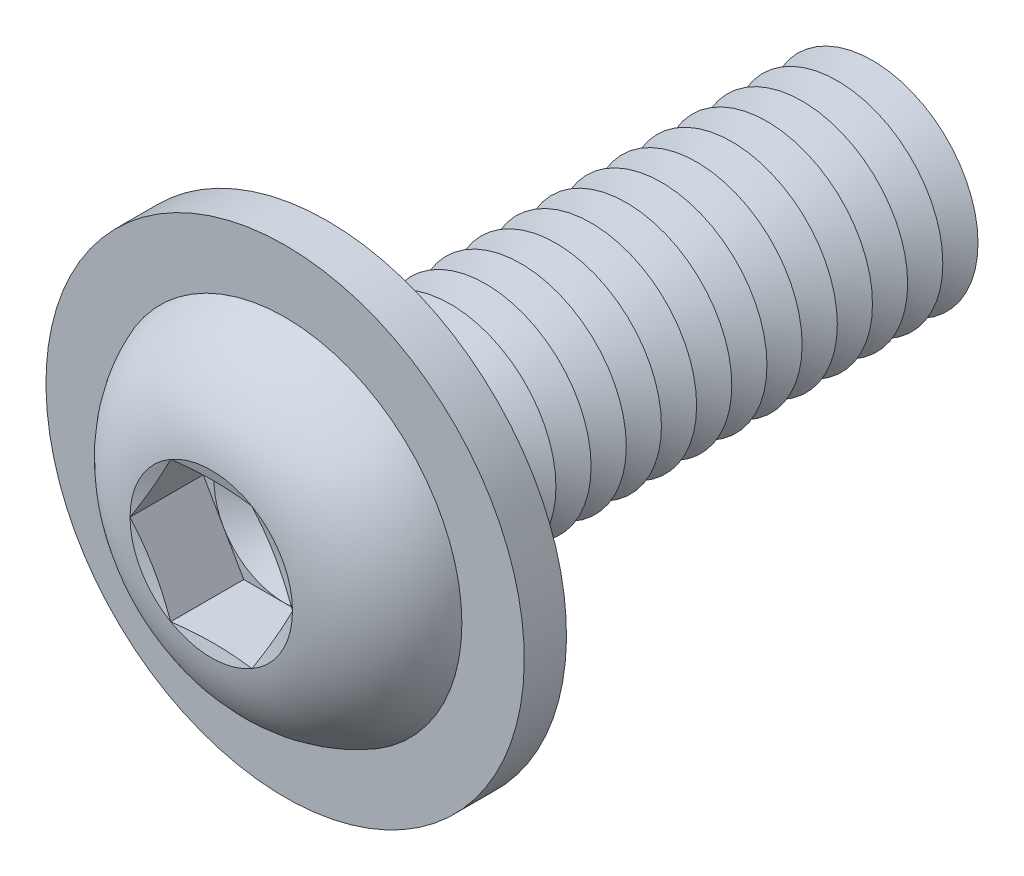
ISO-10303-21;
HEADER;
FILE_DESCRIPTION(('STEP AP214'),'2;1');
FILE_NAME('part.step','',(''),(''),'','','');
FILE_SCHEMA(('AUTOMOTIVE_DESIGN { 1 0 10303 214 1 1 1 1 }'));
ENDSEC;
DATA;
#1=APPLICATION_CONTEXT('core data for automotive mechanical design processes');
#2=APPLICATION_PROTOCOL_DEFINITION('international standard','automotive_design',2000,#1);
#3=PRODUCT_CONTEXT('',#1,'mechanical');
#4=PRODUCT('Part','Part','',(#3));
#5=PRODUCT_RELATED_PRODUCT_CATEGORY('part','',(#4));
#6=PRODUCT_DEFINITION_FORMATION('','',#4);
#7=PRODUCT_DEFINITION_CONTEXT('part definition',#1,'design');
#8=PRODUCT_DEFINITION('design','',#6,#7);
#9=PRODUCT_DEFINITION_SHAPE('','',#8);
#10=(LENGTH_UNIT() NAMED_UNIT(*) SI_UNIT(.MILLI.,.METRE.));
#11=(NAMED_UNIT(*) PLANE_ANGLE_UNIT() SI_UNIT($,.RADIAN.));
#12=(NAMED_UNIT(*) SI_UNIT($,.STERADIAN.) SOLID_ANGLE_UNIT());
#13=UNCERTAINTY_MEASURE_WITH_UNIT(LENGTH_MEASURE(1.E-05),#10,'distance_accuracy_value','');
#14=(GEOMETRIC_REPRESENTATION_CONTEXT(3) GLOBAL_UNCERTAINTY_ASSIGNED_CONTEXT((#13)) GLOBAL_UNIT_ASSIGNED_CONTEXT((#10,
#11,#12)) REPRESENTATION_CONTEXT('',''));
#15=CARTESIAN_POINT('',(0.,0.,0.));
#16=DIRECTION('',(0.,0.,1.));
#17=DIRECTION('',(1.,0.,0.));
#18=AXIS2_PLACEMENT_3D('',#15,#16,#17);
#19=CARTESIAN_POINT('',(0.,0.,-12.5));
#20=DIRECTION('',(0.,0.,1.));
#21=DIRECTION('',(1.,0.,0.));
#22=AXIS2_PLACEMENT_3D('',#19,#20,#21);
#23=CONICAL_SURFACE('',#22,3.00000000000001,1.0471975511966);
#24=CARTESIAN_POINT('',(0.,0.,-13.));
#25=DIRECTION('',(0.,0.,1.));
#26=DIRECTION('',(1.,0.,0.));
#27=AXIS2_PLACEMENT_3D('',#24,#25,#26);
#28=CIRCLE('',#27,2.13397459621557);
#29=CARTESIAN_POINT('',(2.13397459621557,0.,-13.));
#30=VERTEX_POINT('',#29);
#31=EDGE_CURVE('E338',#30,#30,#28,.T.);
#32=ORIENTED_EDGE('',*,*,#31,.T.);
#33=EDGE_LOOP('',(#32));
#34=FACE_BOUND('',#33,.T.);
#35=CARTESIAN_POINT('',(0.,0.,-12.5));
#36=DIRECTION('',(0.,0.,1.));
#37=DIRECTION('',(1.,0.,0.));
#38=AXIS2_PLACEMENT_3D('',#35,#36,#37);
#39=CIRCLE('',#38,3.00000000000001);
#40=CARTESIAN_POINT('',(3.00000000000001,0.,-12.5));
#41=VERTEX_POINT('',#40);
#42=EDGE_CURVE('E334',#41,#41,#39,.T.);
#43=ORIENTED_EDGE('',*,*,#42,.F.);
#44=EDGE_LOOP('',(#43));
#45=FACE_BOUND('',#44,.T.);
#46=ADVANCED_FACE('F39',(#34,#45),#23,.T.);
#47=CARTESIAN_POINT('',(0.,0.,-13.));
#48=DIRECTION('',(0.,0.,-1.));
#49=DIRECTION('',(-1.,0.,0.));
#50=AXIS2_PLACEMENT_3D('',#47,#48,#49);
#51=CONICAL_SURFACE('',#50,2.13397459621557,1.0471975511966);
#52=CARTESIAN_POINT('',(0.,0.,-13.5));
#53=DIRECTION('',(0.,0.,1.));
#54=DIRECTION('',(1.,0.,0.));
#55=AXIS2_PLACEMENT_3D('',#52,#53,#54);
#56=CIRCLE('',#55,3.00000000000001);
#57=CARTESIAN_POINT('',(3.00000000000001,0.,-13.5));
#58=VERTEX_POINT('',#57);
#59=EDGE_CURVE('E342',#58,#58,#56,.T.);
#60=ORIENTED_EDGE('',*,*,#59,.T.);
#61=EDGE_LOOP('',(#60));
#62=FACE_BOUND('',#61,.T.);
#63=ORIENTED_EDGE('',*,*,#31,.F.);
#64=EDGE_LOOP('',(#63));
#65=FACE_BOUND('',#64,.T.);
#66=ADVANCED_FACE('F465',(#62,#65),#51,.T.);
#67=CARTESIAN_POINT('',(0.,3.00000000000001,-16.));
#68=DIRECTION('',(0.,0.,-1.));
#69=DIRECTION('',(-1.,0.,0.));
#70=AXIS2_PLACEMENT_3D('',#67,#68,#69);
#71=PLANE('',#70);
#72=CARTESIAN_POINT('',(0.,0.,-16.));
#73=DIRECTION('',(0.,0.,1.));
#74=DIRECTION('',(1.,0.,0.));
#75=AXIS2_PLACEMENT_3D('',#72,#73,#74);
#76=CIRCLE('',#75,2.13397459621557);
#77=CARTESIAN_POINT('',(2.13397459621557,0.,-16.));
#78=VERTEX_POINT('',#77);
#79=EDGE_CURVE('E362',#78,#78,#76,.T.);
#80=ORIENTED_EDGE('',*,*,#79,.F.);
#81=EDGE_LOOP('',(#80));
#82=FACE_BOUND('',#81,.T.);
#83=ADVANCED_FACE('F471',(#82),#71,.T.);
#84=CARTESIAN_POINT('',(0.,0.,-15.5));
#85=DIRECTION('',(0.,0.,1.));
#86=DIRECTION('',(1.,0.,0.));
#87=AXIS2_PLACEMENT_3D('',#84,#85,#86);
#88=CONICAL_SURFACE('',#87,3.00000000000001,1.0471975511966);
#89=ORIENTED_EDGE('',*,*,#79,.T.);
#90=EDGE_LOOP('',(#89));
#91=FACE_BOUND('',#90,.T.);
#92=CARTESIAN_POINT('',(0.,0.,-15.5));
#93=DIRECTION('',(0.,0.,1.));
#94=DIRECTION('',(1.,0.,0.));
#95=AXIS2_PLACEMENT_3D('',#92,#93,#94);
#96=CIRCLE('',#95,3.00000000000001);
#97=CARTESIAN_POINT('',(3.00000000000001,0.,-15.5));
#98=VERTEX_POINT('',#97);
#99=EDGE_CURVE('E358',#98,#98,#96,.T.);
#100=ORIENTED_EDGE('',*,*,#99,.F.);
#101=EDGE_LOOP('',(#100));
#102=FACE_BOUND('',#101,.T.);
#103=ADVANCED_FACE('F490',(#91,#102),#88,.T.);
#104=CARTESIAN_POINT('',(0.,0.,-15.));
#105=DIRECTION('',(0.,0.,-1.));
#106=DIRECTION('',(-1.,0.,0.));
#107=AXIS2_PLACEMENT_3D('',#104,#105,#106);
#108=CONICAL_SURFACE('',#107,2.13397459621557,1.0471975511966);
#109=ORIENTED_EDGE('',*,*,#99,.T.);
#110=EDGE_LOOP('',(#109));
#111=FACE_BOUND('',#110,.T.);
#112=CARTESIAN_POINT('',(0.,0.,-15.));
#113=DIRECTION('',(0.,0.,1.));
#114=DIRECTION('',(1.,0.,0.));
#115=AXIS2_PLACEMENT_3D('',#112,#113,#114);
#116=CIRCLE('',#115,2.13397459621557);
#117=CARTESIAN_POINT('',(2.13397459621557,0.,-15.));
#118=VERTEX_POINT('',#117);
#119=EDGE_CURVE('E354',#118,#118,#116,.T.);
#120=ORIENTED_EDGE('',*,*,#119,.F.);
#121=EDGE_LOOP('',(#120));
#122=FACE_BOUND('',#121,.T.);
#123=ADVANCED_FACE('F487',(#111,#122),#108,.T.);
#124=CARTESIAN_POINT('',(0.,0.,-14.5));
#125=DIRECTION('',(0.,0.,1.));
#126=DIRECTION('',(1.,0.,0.));
#127=AXIS2_PLACEMENT_3D('',#124,#125,#126);
#128=CONICAL_SURFACE('',#127,3.00000000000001,1.0471975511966);
#129=ORIENTED_EDGE('',*,*,#119,.T.);
#130=EDGE_LOOP('',(#129));
#131=FACE_BOUND('',#130,.T.);
#132=CARTESIAN_POINT('',(0.,0.,-14.5));
#133=DIRECTION('',(0.,0.,1.));
#134=DIRECTION('',(1.,0.,0.));
#135=AXIS2_PLACEMENT_3D('',#132,#133,#134);
#136=CIRCLE('',#135,3.00000000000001);
#137=CARTESIAN_POINT('',(3.00000000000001,0.,-14.5));
#138=VERTEX_POINT('',#137);
#139=EDGE_CURVE('E350',#138,#138,#136,.T.);
#140=ORIENTED_EDGE('',*,*,#139,.F.);
#141=EDGE_LOOP('',(#140));
#142=FACE_BOUND('',#141,.T.);
#143=ADVANCED_FACE('F481',(#131,#142),#128,.T.);
#144=CARTESIAN_POINT('',(0.,0.,-14.));
#145=DIRECTION('',(0.,0.,-1.));
#146=DIRECTION('',(-1.,0.,0.));
#147=AXIS2_PLACEMENT_3D('',#144,#145,#146);
#148=CONICAL_SURFACE('',#147,2.13397459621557,1.0471975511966);
#149=ORIENTED_EDGE('',*,*,#139,.T.);
#150=EDGE_LOOP('',(#149));
#151=FACE_BOUND('',#150,.T.);
#152=CARTESIAN_POINT('',(0.,0.,-14.));
#153=DIRECTION('',(0.,0.,1.));
#154=DIRECTION('',(1.,0.,0.));
#155=AXIS2_PLACEMENT_3D('',#152,#153,#154);
#156=CIRCLE('',#155,2.13397459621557);
#157=CARTESIAN_POINT('',(2.13397459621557,0.,-14.));
#158=VERTEX_POINT('',#157);
#159=EDGE_CURVE('E346',#158,#158,#156,.T.);
#160=ORIENTED_EDGE('',*,*,#159,.F.);
#161=EDGE_LOOP('',(#160));
#162=FACE_BOUND('',#161,.T.);
#163=ADVANCED_FACE('F477',(#151,#162),#148,.T.);
#164=CARTESIAN_POINT('',(0.,0.,-13.5));
#165=DIRECTION('',(0.,0.,1.));
#166=DIRECTION('',(1.,0.,0.));
#167=AXIS2_PLACEMENT_3D('',#164,#165,#166);
#168=CONICAL_SURFACE('',#167,3.00000000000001,1.0471975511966);
#169=ORIENTED_EDGE('',*,*,#159,.T.);
#170=EDGE_LOOP('',(#169));
#171=FACE_BOUND('',#170,.T.);
#172=ORIENTED_EDGE('',*,*,#59,.F.);
#173=EDGE_LOOP('',(#172));
#174=FACE_BOUND('',#173,.T.);
#175=ADVANCED_FACE('F480',(#171,#174),#168,.T.);
#176=CARTESIAN_POINT('',(0.,0.,-11.5));
#177=DIRECTION('',(0.,0.,1.));
#178=DIRECTION('',(1.,0.,0.));
#179=AXIS2_PLACEMENT_3D('',#176,#177,#178);
#180=CONICAL_SURFACE('',#179,3.00000000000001,1.0471975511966);
#181=CARTESIAN_POINT('',(0.,0.,-12.));
#182=DIRECTION('',(0.,0.,1.));
#183=DIRECTION('',(1.,0.,0.));
#184=AXIS2_PLACEMENT_3D('',#181,#182,#183);
#185=CIRCLE('',#184,2.13397459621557);
#186=CARTESIAN_POINT('',(2.13397459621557,0.,-12.));
#187=VERTEX_POINT('',#186);
#188=EDGE_CURVE('E330',#187,#187,#185,.T.);
#189=ORIENTED_EDGE('',*,*,#188,.T.);
#190=EDGE_LOOP('',(#189));
#191=FACE_BOUND('',#190,.T.);
#192=CARTESIAN_POINT('',(0.,0.,-11.5));
#193=DIRECTION('',(0.,0.,1.));
#194=DIRECTION('',(1.,0.,0.));
#195=AXIS2_PLACEMENT_3D('',#192,#193,#194);
#196=CIRCLE('',#195,3.00000000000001);
#197=CARTESIAN_POINT('',(3.00000000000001,0.,-11.5));
#198=VERTEX_POINT('',#197);
#199=EDGE_CURVE('E326',#198,#198,#196,.T.);
#200=ORIENTED_EDGE('',*,*,#199,.F.);
#201=EDGE_LOOP('',(#200));
#202=FACE_BOUND('',#201,.T.);
#203=ADVANCED_FACE('F485',(#191,#202),#180,.T.);
#204=CARTESIAN_POINT('',(0.,0.,-12.));
#205=DIRECTION('',(0.,0.,-1.));
#206=DIRECTION('',(-1.,0.,0.));
#207=AXIS2_PLACEMENT_3D('',#204,#205,#206);
#208=CONICAL_SURFACE('',#207,2.13397459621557,1.0471975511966);
#209=ORIENTED_EDGE('',*,*,#42,.T.);
#210=EDGE_LOOP('',(#209));
#211=FACE_BOUND('',#210,.T.);
#212=ORIENTED_EDGE('',*,*,#188,.F.);
#213=EDGE_LOOP('',(#212));
#214=FACE_BOUND('',#213,.T.);
#215=ADVANCED_FACE('F536',(#211,#214),#208,.T.);
#216=CARTESIAN_POINT('',(0.,0.,-10.5));
#217=DIRECTION('',(0.,0.,1.));
#218=DIRECTION('',(1.,0.,0.));
#219=AXIS2_PLACEMENT_3D('',#216,#217,#218);
#220=CONICAL_SURFACE('',#219,3.00000000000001,1.0471975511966);
#221=CARTESIAN_POINT('',(0.,0.,-11.));
#222=DIRECTION('',(0.,0.,1.));
#223=DIRECTION('',(1.,0.,0.));
#224=AXIS2_PLACEMENT_3D('',#221,#222,#223);
#225=CIRCLE('',#224,2.13397459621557);
#226=CARTESIAN_POINT('',(2.13397459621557,0.,-11.));
#227=VERTEX_POINT('',#226);
#228=EDGE_CURVE('E322',#227,#227,#225,.T.);
#229=ORIENTED_EDGE('',*,*,#228,.T.);
#230=EDGE_LOOP('',(#229));
#231=FACE_BOUND('',#230,.T.);
#232=CARTESIAN_POINT('',(0.,0.,-10.5));
#233=DIRECTION('',(0.,0.,1.));
#234=DIRECTION('',(1.,0.,0.));
#235=AXIS2_PLACEMENT_3D('',#232,#233,#234);
#236=CIRCLE('',#235,3.00000000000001);
#237=CARTESIAN_POINT('',(3.00000000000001,0.,-10.5));
#238=VERTEX_POINT('',#237);
#239=EDGE_CURVE('E319',#238,#238,#236,.T.);
#240=ORIENTED_EDGE('',*,*,#239,.F.);
#241=EDGE_LOOP('',(#240));
#242=FACE_BOUND('',#241,.T.);
#243=ADVANCED_FACE('F542',(#231,#242),#220,.T.);
#244=CARTESIAN_POINT('',(0.,0.,-11.));
#245=DIRECTION('',(0.,0.,-1.));
#246=DIRECTION('',(-1.,0.,0.));
#247=AXIS2_PLACEMENT_3D('',#244,#245,#246);
#248=CONICAL_SURFACE('',#247,2.13397459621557,1.0471975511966);
#249=ORIENTED_EDGE('',*,*,#199,.T.);
#250=EDGE_LOOP('',(#249));
#251=FACE_BOUND('',#250,.T.);
#252=ORIENTED_EDGE('',*,*,#228,.F.);
#253=EDGE_LOOP('',(#252));
#254=FACE_BOUND('',#253,.T.);
#255=ADVANCED_FACE('F549',(#251,#254),#248,.T.);
#256=CARTESIAN_POINT('',(0.,0.,-9.5));
#257=DIRECTION('',(0.,0.,1.));
#258=DIRECTION('',(1.,0.,0.));
#259=AXIS2_PLACEMENT_3D('',#256,#257,#258);
#260=CONICAL_SURFACE('',#259,3.00000000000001,1.0471975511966);
#261=CARTESIAN_POINT('',(0.,0.,-10.));
#262=DIRECTION('',(0.,0.,1.));
#263=DIRECTION('',(1.,0.,0.));
#264=AXIS2_PLACEMENT_3D('',#261,#262,#263);
#265=CIRCLE('',#264,2.13397459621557);
#266=CARTESIAN_POINT('',(2.13397459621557,0.,-10.));
#267=VERTEX_POINT('',#266);
#268=EDGE_CURVE('E315',#267,#267,#265,.T.);
#269=ORIENTED_EDGE('',*,*,#268,.T.);
#270=EDGE_LOOP('',(#269));
#271=FACE_BOUND('',#270,.T.);
#272=CARTESIAN_POINT('',(0.,0.,-9.50000000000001));
#273=DIRECTION('',(0.,0.,1.));
#274=DIRECTION('',(1.,0.,0.));
#275=AXIS2_PLACEMENT_3D('',#272,#273,#274);
#276=CIRCLE('',#275,3.00000000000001);
#277=CARTESIAN_POINT('',(3.00000000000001,0.,-9.50000000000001));
#278=VERTEX_POINT('',#277);
#279=EDGE_CURVE('E311',#278,#278,#276,.T.);
#280=ORIENTED_EDGE('',*,*,#279,.F.);
#281=EDGE_LOOP('',(#280));
#282=FACE_BOUND('',#281,.T.);
#283=ADVANCED_FACE('F556',(#271,#282),#260,.T.);
#284=CARTESIAN_POINT('',(0.,0.,-10.));
#285=DIRECTION('',(0.,0.,-1.));
#286=DIRECTION('',(-1.,0.,0.));
#287=AXIS2_PLACEMENT_3D('',#284,#285,#286);
#288=CONICAL_SURFACE('',#287,2.13397459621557,1.0471975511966);
#289=ORIENTED_EDGE('',*,*,#239,.T.);
#290=EDGE_LOOP('',(#289));
#291=FACE_BOUND('',#290,.T.);
#292=ORIENTED_EDGE('',*,*,#268,.F.);
#293=EDGE_LOOP('',(#292));
#294=FACE_BOUND('',#293,.T.);
#295=ADVANCED_FACE('F563',(#291,#294),#288,.T.);
#296=CARTESIAN_POINT('',(0.,0.,-8.5));
#297=DIRECTION('',(0.,0.,1.));
#298=DIRECTION('',(1.,0.,0.));
#299=AXIS2_PLACEMENT_3D('',#296,#297,#298);
#300=CONICAL_SURFACE('',#299,3.00000000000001,1.0471975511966);
#301=CARTESIAN_POINT('',(0.,0.,-9.00000000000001));
#302=DIRECTION('',(0.,0.,1.));
#303=DIRECTION('',(1.,0.,0.));
#304=AXIS2_PLACEMENT_3D('',#301,#302,#303);
#305=CIRCLE('',#304,2.13397459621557);
#306=CARTESIAN_POINT('',(2.13397459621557,0.,-9.00000000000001));
#307=VERTEX_POINT('',#306);
#308=EDGE_CURVE('E307',#307,#307,#305,.T.);
#309=ORIENTED_EDGE('',*,*,#308,.T.);
#310=EDGE_LOOP('',(#309));
#311=FACE_BOUND('',#310,.T.);
#312=CARTESIAN_POINT('',(0.,0.,-8.5));
#313=DIRECTION('',(0.,0.,1.));
#314=DIRECTION('',(1.,0.,0.));
#315=AXIS2_PLACEMENT_3D('',#312,#313,#314);
#316=CIRCLE('',#315,3.00000000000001);
#317=CARTESIAN_POINT('',(3.00000000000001,0.,-8.5));
#318=VERTEX_POINT('',#317);
#319=EDGE_CURVE('E303',#318,#318,#316,.T.);
#320=ORIENTED_EDGE('',*,*,#319,.F.);
#321=EDGE_LOOP('',(#320));
#322=FACE_BOUND('',#321,.T.);
#323=ADVANCED_FACE('F570',(#311,#322),#300,.T.);
#324=CARTESIAN_POINT('',(0.,0.,-9.00000000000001));
#325=DIRECTION('',(0.,0.,-1.));
#326=DIRECTION('',(-1.,0.,0.));
#327=AXIS2_PLACEMENT_3D('',#324,#325,#326);
#328=CONICAL_SURFACE('',#327,2.13397459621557,1.0471975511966);
#329=ORIENTED_EDGE('',*,*,#279,.T.);
#330=EDGE_LOOP('',(#329));
#331=FACE_BOUND('',#330,.T.);
#332=ORIENTED_EDGE('',*,*,#308,.F.);
#333=EDGE_LOOP('',(#332));
#334=FACE_BOUND('',#333,.T.);
#335=ADVANCED_FACE('F577',(#331,#334),#328,.T.);
#336=CARTESIAN_POINT('',(0.,0.,-7.5));
#337=DIRECTION('',(0.,0.,1.));
#338=DIRECTION('',(1.,0.,0.));
#339=AXIS2_PLACEMENT_3D('',#336,#337,#338);
#340=CONICAL_SURFACE('',#339,3.00000000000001,1.0471975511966);
#341=CARTESIAN_POINT('',(0.,0.,-8.));
#342=DIRECTION('',(0.,0.,1.));
#343=DIRECTION('',(1.,0.,0.));
#344=AXIS2_PLACEMENT_3D('',#341,#342,#343);
#345=CIRCLE('',#344,2.13397459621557);
#346=CARTESIAN_POINT('',(2.13397459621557,0.,-8.));
#347=VERTEX_POINT('',#346);
#348=EDGE_CURVE('E299',#347,#347,#345,.T.);
#349=ORIENTED_EDGE('',*,*,#348,.T.);
#350=EDGE_LOOP('',(#349));
#351=FACE_BOUND('',#350,.T.);
#352=CARTESIAN_POINT('',(0.,0.,-7.5));
#353=DIRECTION('',(0.,0.,1.));
#354=DIRECTION('',(1.,0.,0.));
#355=AXIS2_PLACEMENT_3D('',#352,#353,#354);
#356=CIRCLE('',#355,3.00000000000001);
#357=CARTESIAN_POINT('',(3.00000000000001,0.,-7.5));
#358=VERTEX_POINT('',#357);
#359=EDGE_CURVE('E295',#358,#358,#356,.T.);
#360=ORIENTED_EDGE('',*,*,#359,.F.);
#361=EDGE_LOOP('',(#360));
#362=FACE_BOUND('',#361,.T.);
#363=ADVANCED_FACE('F584',(#351,#362),#340,.T.);
#364=CARTESIAN_POINT('',(0.,0.,-8.));
#365=DIRECTION('',(0.,0.,-1.));
#366=DIRECTION('',(-1.,0.,0.));
#367=AXIS2_PLACEMENT_3D('',#364,#365,#366);
#368=CONICAL_SURFACE('',#367,2.13397459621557,1.0471975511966);
#369=ORIENTED_EDGE('',*,*,#319,.T.);
#370=EDGE_LOOP('',(#369));
#371=FACE_BOUND('',#370,.T.);
#372=ORIENTED_EDGE('',*,*,#348,.F.);
#373=EDGE_LOOP('',(#372));
#374=FACE_BOUND('',#373,.T.);
#375=ADVANCED_FACE('F591',(#371,#374),#368,.T.);
#376=CARTESIAN_POINT('',(0.,0.,-6.5));
#377=DIRECTION('',(0.,0.,1.));
#378=DIRECTION('',(1.,0.,0.));
#379=AXIS2_PLACEMENT_3D('',#376,#377,#378);
#380=CONICAL_SURFACE('',#379,3.00000000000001,1.0471975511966);
#381=CARTESIAN_POINT('',(0.,0.,-7.));
#382=DIRECTION('',(0.,0.,1.));
#383=DIRECTION('',(1.,0.,0.));
#384=AXIS2_PLACEMENT_3D('',#381,#382,#383);
#385=CIRCLE('',#384,2.13397459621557);
#386=CARTESIAN_POINT('',(2.13397459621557,0.,-7.));
#387=VERTEX_POINT('',#386);
#388=EDGE_CURVE('E291',#387,#387,#385,.T.);
#389=ORIENTED_EDGE('',*,*,#388,.T.);
#390=EDGE_LOOP('',(#389));
#391=FACE_BOUND('',#390,.T.);
#392=CARTESIAN_POINT('',(0.,0.,-6.5));
#393=DIRECTION('',(0.,0.,1.));
#394=DIRECTION('',(1.,0.,0.));
#395=AXIS2_PLACEMENT_3D('',#392,#393,#394);
#396=CIRCLE('',#395,3.00000000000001);
#397=CARTESIAN_POINT('',(3.00000000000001,0.,-6.5));
#398=VERTEX_POINT('',#397);
#399=EDGE_CURVE('E287',#398,#398,#396,.T.);
#400=ORIENTED_EDGE('',*,*,#399,.F.);
#401=EDGE_LOOP('',(#400));
#402=FACE_BOUND('',#401,.T.);
#403=ADVANCED_FACE('F598',(#391,#402),#380,.T.);
#404=CARTESIAN_POINT('',(0.,0.,-7.));
#405=DIRECTION('',(0.,0.,-1.));
#406=DIRECTION('',(-1.,0.,0.));
#407=AXIS2_PLACEMENT_3D('',#404,#405,#406);
#408=CONICAL_SURFACE('',#407,2.13397459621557,1.0471975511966);
#409=ORIENTED_EDGE('',*,*,#359,.T.);
#410=EDGE_LOOP('',(#409));
#411=FACE_BOUND('',#410,.T.);
#412=ORIENTED_EDGE('',*,*,#388,.F.);
#413=EDGE_LOOP('',(#412));
#414=FACE_BOUND('',#413,.T.);
#415=ADVANCED_FACE('F605',(#411,#414),#408,.T.);
#416=CARTESIAN_POINT('',(0.,0.,-5.5));
#417=DIRECTION('',(0.,0.,1.));
#418=DIRECTION('',(1.,0.,0.));
#419=AXIS2_PLACEMENT_3D('',#416,#417,#418);
#420=CONICAL_SURFACE('',#419,3.00000000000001,1.0471975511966);
#421=CARTESIAN_POINT('',(0.,0.,-6.));
#422=DIRECTION('',(0.,0.,1.));
#423=DIRECTION('',(1.,0.,0.));
#424=AXIS2_PLACEMENT_3D('',#421,#422,#423);
#425=CIRCLE('',#424,2.13397459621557);
#426=CARTESIAN_POINT('',(2.13397459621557,0.,-6.));
#427=VERTEX_POINT('',#426);
#428=EDGE_CURVE('E283',#427,#427,#425,.T.);
#429=ORIENTED_EDGE('',*,*,#428,.T.);
#430=EDGE_LOOP('',(#429));
#431=FACE_BOUND('',#430,.T.);
#432=CARTESIAN_POINT('',(0.,0.,-5.50000000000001));
#433=DIRECTION('',(0.,0.,1.));
#434=DIRECTION('',(1.,0.,0.));
#435=AXIS2_PLACEMENT_3D('',#432,#433,#434);
#436=CIRCLE('',#435,3.00000000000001);
#437=CARTESIAN_POINT('',(3.00000000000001,0.,-5.50000000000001));
#438=VERTEX_POINT('',#437);
#439=EDGE_CURVE('E279',#438,#438,#436,.T.);
#440=ORIENTED_EDGE('',*,*,#439,.F.);
#441=EDGE_LOOP('',(#440));
#442=FACE_BOUND('',#441,.T.);
#443=ADVANCED_FACE('F612',(#431,#442),#420,.T.);
#444=CARTESIAN_POINT('',(0.,0.,-6.));
#445=DIRECTION('',(0.,0.,-1.));
#446=DIRECTION('',(-1.,0.,0.));
#447=AXIS2_PLACEMENT_3D('',#444,#445,#446);
#448=CONICAL_SURFACE('',#447,2.13397459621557,1.0471975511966);
#449=ORIENTED_EDGE('',*,*,#399,.T.);
#450=EDGE_LOOP('',(#449));
#451=FACE_BOUND('',#450,.T.);
#452=ORIENTED_EDGE('',*,*,#428,.F.);
#453=EDGE_LOOP('',(#452));
#454=FACE_BOUND('',#453,.T.);
#455=ADVANCED_FACE('F619',(#451,#454),#448,.T.);
#456=CARTESIAN_POINT('',(0.,0.,-4.5));
#457=DIRECTION('',(0.,0.,1.));
#458=DIRECTION('',(1.,0.,0.));
#459=AXIS2_PLACEMENT_3D('',#456,#457,#458);
#460=CONICAL_SURFACE('',#459,3.00000000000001,1.0471975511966);
#461=CARTESIAN_POINT('',(0.,0.,-5.));
#462=DIRECTION('',(0.,0.,1.));
#463=DIRECTION('',(1.,0.,0.));
#464=AXIS2_PLACEMENT_3D('',#461,#462,#463);
#465=CIRCLE('',#464,2.13397459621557);
#466=CARTESIAN_POINT('',(2.13397459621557,0.,-5.));
#467=VERTEX_POINT('',#466);
#468=EDGE_CURVE('E275',#467,#467,#465,.T.);
#469=ORIENTED_EDGE('',*,*,#468,.T.);
#470=EDGE_LOOP('',(#469));
#471=FACE_BOUND('',#470,.T.);
#472=CARTESIAN_POINT('',(0.,0.,-4.5));
#473=DIRECTION('',(0.,0.,1.));
#474=DIRECTION('',(1.,0.,0.));
#475=AXIS2_PLACEMENT_3D('',#472,#473,#474);
#476=CIRCLE('',#475,3.00000000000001);
#477=CARTESIAN_POINT('',(3.00000000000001,0.,-4.5));
#478=VERTEX_POINT('',#477);
#479=EDGE_CURVE('E271',#478,#478,#476,.T.);
#480=ORIENTED_EDGE('',*,*,#479,.F.);
#481=EDGE_LOOP('',(#480));
#482=FACE_BOUND('',#481,.T.);
#483=ADVANCED_FACE('F626',(#471,#482),#460,.T.);
#484=CARTESIAN_POINT('',(0.,0.,-5.));
#485=DIRECTION('',(0.,0.,-1.));
#486=DIRECTION('',(-1.,0.,0.));
#487=AXIS2_PLACEMENT_3D('',#484,#485,#486);
#488=CONICAL_SURFACE('',#487,2.13397459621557,1.0471975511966);
#489=ORIENTED_EDGE('',*,*,#439,.T.);
#490=EDGE_LOOP('',(#489));
#491=FACE_BOUND('',#490,.T.);
#492=ORIENTED_EDGE('',*,*,#468,.F.);
#493=EDGE_LOOP('',(#492));
#494=FACE_BOUND('',#493,.T.);
#495=ADVANCED_FACE('F633',(#491,#494),#488,.T.);
#496=CARTESIAN_POINT('',(0.,0.,-3.5));
#497=DIRECTION('',(0.,0.,1.));
#498=DIRECTION('',(1.,0.,0.));
#499=AXIS2_PLACEMENT_3D('',#496,#497,#498);
#500=CONICAL_SURFACE('',#499,3.00000000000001,1.0471975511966);
#501=CARTESIAN_POINT('',(0.,0.,-4.));
#502=DIRECTION('',(0.,0.,1.));
#503=DIRECTION('',(1.,0.,0.));
#504=AXIS2_PLACEMENT_3D('',#501,#502,#503);
#505=CIRCLE('',#504,2.13397459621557);
#506=CARTESIAN_POINT('',(2.13397459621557,0.,-4.));
#507=VERTEX_POINT('',#506);
#508=EDGE_CURVE('E267',#507,#507,#505,.T.);
#509=ORIENTED_EDGE('',*,*,#508,.T.);
#510=EDGE_LOOP('',(#509));
#511=FACE_BOUND('',#510,.T.);
#512=CARTESIAN_POINT('',(0.,0.,-3.5));
#513=DIRECTION('',(0.,0.,1.));
#514=DIRECTION('',(1.,0.,0.));
#515=AXIS2_PLACEMENT_3D('',#512,#513,#514);
#516=CIRCLE('',#515,3.00000000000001);
#517=CARTESIAN_POINT('',(3.00000000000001,0.,-3.5));
#518=VERTEX_POINT('',#517);
#519=EDGE_CURVE('E263',#518,#518,#516,.T.);
#520=ORIENTED_EDGE('',*,*,#519,.F.);
#521=EDGE_LOOP('',(#520));
#522=FACE_BOUND('',#521,.T.);
#523=ADVANCED_FACE('F640',(#511,#522),#500,.T.);
#524=CARTESIAN_POINT('',(0.,0.,-4.));
#525=DIRECTION('',(0.,0.,-1.));
#526=DIRECTION('',(-1.,0.,0.));
#527=AXIS2_PLACEMENT_3D('',#524,#525,#526);
#528=CONICAL_SURFACE('',#527,2.13397459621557,1.0471975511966);
#529=ORIENTED_EDGE('',*,*,#479,.T.);
#530=EDGE_LOOP('',(#529));
#531=FACE_BOUND('',#530,.T.);
#532=ORIENTED_EDGE('',*,*,#508,.F.);
#533=EDGE_LOOP('',(#532));
#534=FACE_BOUND('',#533,.T.);
#535=ADVANCED_FACE('F647',(#531,#534),#528,.T.);
#536=CARTESIAN_POINT('',(0.,0.,-2.5));
#537=DIRECTION('',(0.,0.,1.));
#538=DIRECTION('',(1.,0.,0.));
#539=AXIS2_PLACEMENT_3D('',#536,#537,#538);
#540=CONICAL_SURFACE('',#539,3.00000000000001,1.0471975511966);
#541=CARTESIAN_POINT('',(0.,0.,-3.));
#542=DIRECTION('',(0.,0.,1.));
#543=DIRECTION('',(1.,0.,0.));
#544=AXIS2_PLACEMENT_3D('',#541,#542,#543);
#545=CIRCLE('',#544,2.13397459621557);
#546=CARTESIAN_POINT('',(2.13397459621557,0.,-3.));
#547=VERTEX_POINT('',#546);
#548=EDGE_CURVE('E259',#547,#547,#545,.T.);
#549=ORIENTED_EDGE('',*,*,#548,.T.);
#550=EDGE_LOOP('',(#549));
#551=FACE_BOUND('',#550,.T.);
#552=CARTESIAN_POINT('',(0.,0.,-2.5));
#553=DIRECTION('',(0.,0.,1.));
#554=DIRECTION('',(1.,0.,0.));
#555=AXIS2_PLACEMENT_3D('',#552,#553,#554);
#556=CIRCLE('',#555,3.00000000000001);
#557=CARTESIAN_POINT('',(3.00000000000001,0.,-2.5));
#558=VERTEX_POINT('',#557);
#559=EDGE_CURVE('E255',#558,#558,#556,.T.);
#560=ORIENTED_EDGE('',*,*,#559,.F.);
#561=EDGE_LOOP('',(#560));
#562=FACE_BOUND('',#561,.T.);
#563=ADVANCED_FACE('F654',(#551,#562),#540,.T.);
#564=CARTESIAN_POINT('',(0.,0.,-3.));
#565=DIRECTION('',(0.,0.,-1.));
#566=DIRECTION('',(-1.,0.,0.));
#567=AXIS2_PLACEMENT_3D('',#564,#565,#566);
#568=CONICAL_SURFACE('',#567,2.13397459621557,1.0471975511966);
#569=ORIENTED_EDGE('',*,*,#519,.T.);
#570=EDGE_LOOP('',(#569));
#571=FACE_BOUND('',#570,.T.);
#572=ORIENTED_EDGE('',*,*,#548,.F.);
#573=EDGE_LOOP('',(#572));
#574=FACE_BOUND('',#573,.T.);
#575=ADVANCED_FACE('F661',(#571,#574),#568,.T.);
#576=CARTESIAN_POINT('',(0.,0.,-1.5));
#577=DIRECTION('',(0.,0.,1.));
#578=DIRECTION('',(1.,0.,0.));
#579=AXIS2_PLACEMENT_3D('',#576,#577,#578);
#580=CONICAL_SURFACE('',#579,3.00000000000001,1.0471975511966);
#581=CARTESIAN_POINT('',(0.,0.,-2.));
#582=DIRECTION('',(0.,0.,1.));
#583=DIRECTION('',(1.,0.,0.));
#584=AXIS2_PLACEMENT_3D('',#581,#582,#583);
#585=CIRCLE('',#584,2.13397459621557);
#586=CARTESIAN_POINT('',(2.13397459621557,0.,-2.));
#587=VERTEX_POINT('',#586);
#588=EDGE_CURVE('E251',#587,#587,#585,.T.);
#589=ORIENTED_EDGE('',*,*,#588,.T.);
#590=EDGE_LOOP('',(#589));
#591=FACE_BOUND('',#590,.T.);
#592=CARTESIAN_POINT('',(0.,0.,-1.5));
#593=DIRECTION('',(0.,0.,1.));
#594=DIRECTION('',(1.,0.,0.));
#595=AXIS2_PLACEMENT_3D('',#592,#593,#594);
#596=CIRCLE('',#595,3.00000000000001);
#597=CARTESIAN_POINT('',(3.00000000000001,0.,-1.5));
#598=VERTEX_POINT('',#597);
#599=EDGE_CURVE('E243',#598,#598,#596,.T.);
#600=ORIENTED_EDGE('',*,*,#599,.F.);
#601=EDGE_LOOP('',(#600));
#602=FACE_BOUND('',#601,.T.);
#603=ADVANCED_FACE('F668',(#591,#602),#580,.T.);
#604=CARTESIAN_POINT('',(0.,0.,-2.));
#605=DIRECTION('',(0.,0.,-1.));
#606=DIRECTION('',(-1.,0.,0.));
#607=AXIS2_PLACEMENT_3D('',#604,#605,#606);
#608=CONICAL_SURFACE('',#607,2.13397459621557,1.0471975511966);
#609=ORIENTED_EDGE('',*,*,#559,.T.);
#610=EDGE_LOOP('',(#609));
#611=FACE_BOUND('',#610,.T.);
#612=ORIENTED_EDGE('',*,*,#588,.F.);
#613=EDGE_LOOP('',(#612));
#614=FACE_BOUND('',#613,.T.);
#615=ADVANCED_FACE('F675',(#611,#614),#608,.T.);
#616=CARTESIAN_POINT('',(0.,0.,-0.500000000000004));
#617=DIRECTION('',(0.,0.,1.));
#618=DIRECTION('',(1.,0.,0.));
#619=AXIS2_PLACEMENT_3D('',#616,#617,#618);
#620=CONICAL_SURFACE('',#619,3.00000000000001,1.0471975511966);
#621=CARTESIAN_POINT('',(0.,0.,-1.));
#622=DIRECTION('',(0.,0.,1.));
#623=DIRECTION('',(1.,0.,0.));
#624=AXIS2_PLACEMENT_3D('',#621,#622,#623);
#625=CIRCLE('',#624,2.13397459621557);
#626=CARTESIAN_POINT('',(2.13397459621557,0.,-1.));
#627=VERTEX_POINT('',#626);
#628=EDGE_CURVE('E232',#627,#627,#625,.T.);
#629=ORIENTED_EDGE('',*,*,#628,.T.);
#630=EDGE_LOOP('',(#629));
#631=FACE_BOUND('',#630,.T.);
#632=CARTESIAN_POINT('',(0.,0.,-0.500000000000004));
#633=DIRECTION('',(0.,0.,1.));
#634=DIRECTION('',(1.,0.,0.));
#635=AXIS2_PLACEMENT_3D('',#632,#633,#634);
#636=CIRCLE('',#635,3.00000000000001);
#637=CARTESIAN_POINT('',(3.00000000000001,0.,-0.500000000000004));
#638=VERTEX_POINT('',#637);
#639=EDGE_CURVE('E247',#638,#638,#636,.T.);
#640=ORIENTED_EDGE('',*,*,#639,.F.);
#641=EDGE_LOOP('',(#640));
#642=FACE_BOUND('',#641,.T.);
#643=ADVANCED_FACE('F682',(#631,#642),#620,.T.);
#644=CARTESIAN_POINT('',(0.,0.,-1.));
#645=DIRECTION('',(0.,0.,-1.));
#646=DIRECTION('',(-1.,0.,0.));
#647=AXIS2_PLACEMENT_3D('',#644,#645,#646);
#648=CONICAL_SURFACE('',#647,2.13397459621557,1.0471975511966);
#649=ORIENTED_EDGE('',*,*,#599,.T.);
#650=EDGE_LOOP('',(#649));
#651=FACE_BOUND('',#650,.T.);
#652=ORIENTED_EDGE('',*,*,#628,.F.);
#653=EDGE_LOOP('',(#652));
#654=FACE_BOUND('',#653,.T.);
#655=ADVANCED_FACE('F221',(#651,#654),#648,.T.);
#656=CARTESIAN_POINT('',(0.,3.,0.));
#657=DIRECTION('',(0.,0.,-1.));
#658=DIRECTION('',(-1.,0.,0.));
#659=AXIS2_PLACEMENT_3D('',#656,#657,#658);
#660=PLANE('',#659);
#661=CARTESIAN_POINT('',(0.,0.,0.));
#662=DIRECTION('',(0.,0.,-1.));
#663=DIRECTION('',(-1.,0.,0.));
#664=AXIS2_PLACEMENT_3D('',#661,#662,#663);
#665=CIRCLE('',#664,3.5);
#666=CARTESIAN_POINT('',(-3.5,0.,0.));
#667=VERTEX_POINT('',#666);
#668=EDGE_CURVE('E371',#667,#667,#665,.F.);
#669=ORIENTED_EDGE('',*,*,#668,.T.);
#670=EDGE_LOOP('',(#669));
#671=FACE_BOUND('',#670,.T.);
#672=CARTESIAN_POINT('',(0.,0.,0.));
#673=DIRECTION('',(0.,0.,-1.));
#674=DIRECTION('',(0.,1.,0.));
#675=AXIS2_PLACEMENT_3D('',#672,#673,#674);
#676=CIRCLE('',#675,6.8);
#677=CARTESIAN_POINT('',(0.,6.8,0.));
#678=VERTEX_POINT('',#677);
#679=EDGE_CURVE('E1031',#678,#678,#676,.T.);
#680=ORIENTED_EDGE('',*,*,#679,.T.);
#681=EDGE_LOOP('',(#680));
#682=FACE_BOUND('',#681,.T.);
#683=ADVANCED_FACE('F694',(#671,#682),#660,.T.);
#684=CARTESIAN_POINT('',(0.,0.,-0.5));
#685=DIRECTION('',(0.,0.,-1.));
#686=DIRECTION('',(-1.,0.,0.));
#687=AXIS2_PLACEMENT_3D('',#684,#685,#686);
#688=TOROIDAL_SURFACE('',#687,3.5,0.5);
#689=ORIENTED_EDGE('',*,*,#668,.F.);
#690=EDGE_LOOP('',(#689));
#691=FACE_BOUND('',#690,.T.);
#692=ORIENTED_EDGE('',*,*,#639,.T.);
#693=EDGE_LOOP('',(#692));
#694=FACE_BOUND('',#693,.T.);
#695=ADVANCED_FACE('F41',(#691,#694),#688,.F.);
#696=CARTESIAN_POINT('',(0.,0.,1.2));
#697=DIRECTION('',(0.,0.,-1.));
#698=DIRECTION('',(0.,1.,0.));
#699=AXIS2_PLACEMENT_3D('',#696,#697,#698);
#700=CYLINDRICAL_SURFACE('',#699,6.8);
#701=CARTESIAN_POINT('',(0.,0.,1.2));
#702=DIRECTION('',(0.,0.,-1.));
#703=DIRECTION('',(0.,1.,0.));
#704=AXIS2_PLACEMENT_3D('',#701,#702,#703);
#705=CIRCLE('',#704,6.8);
#706=CARTESIAN_POINT('',(0.,6.8,1.2));
#707=VERTEX_POINT('',#706);
#708=EDGE_CURVE('E1033',#707,#707,#705,.T.);
#709=ORIENTED_EDGE('',*,*,#708,.T.);
#710=EDGE_LOOP('',(#709));
#711=FACE_BOUND('',#710,.T.);
#712=ORIENTED_EDGE('',*,*,#679,.F.);
#713=EDGE_LOOP('',(#712));
#714=FACE_BOUND('',#713,.T.);
#715=ADVANCED_FACE('F705',(#711,#714),#700,.T.);
#716=CARTESIAN_POINT('',(0.,0.,1.2));
#717=DIRECTION('',(0.,0.,-1.));
#718=DIRECTION('',(0.,1.,0.));
#719=AXIS2_PLACEMENT_3D('',#716,#717,#718);
#720=PLANE('',#719);
#721=CARTESIAN_POINT('',(0.,0.,1.2));
#722=DIRECTION('',(0.,0.,-1.));
#723=DIRECTION('',(0.,1.,0.));
#724=AXIS2_PLACEMENT_3D('',#721,#722,#723);
#725=CIRCLE('',#724,5.02568742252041);
#726=CARTESIAN_POINT('',(0.,5.02568742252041,1.2));
#727=VERTEX_POINT('',#726);
#728=EDGE_CURVE('E43',#727,#727,#725,.F.);
#729=ORIENTED_EDGE('',*,*,#728,.F.);
#730=EDGE_LOOP('',(#729));
#731=FACE_BOUND('',#730,.T.);
#732=ORIENTED_EDGE('',*,*,#708,.F.);
#733=EDGE_LOOP('',(#732));
#734=FACE_BOUND('',#733,.T.);
#735=ADVANCED_FACE('F117',(#731,#734),#720,.F.);
#736=CARTESIAN_POINT('',(0.,0.,1.22));
#737=DIRECTION('',(0.,0.,1.));
#738=DIRECTION('',(1.,0.,0.));
#739=AXIS2_PLACEMENT_3D('',#736,#737,#738);
#740=CONICAL_SURFACE('',#739,1.99999906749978,1.0471975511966);
#741=CARTESIAN_POINT('',(0.,0.,0.0653000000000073));
#742=VERTEX_POINT('',#741);
#743=VERTEX_LOOP('',#742);
#744=FACE_BOUND('',#743,.T.);
#745=CARTESIAN_POINT('',(0.,0.,1.22));
#746=DIRECTION('',(0.,0.,1.));
#747=DIRECTION('',(1.,0.,0.));
#748=AXIS2_PLACEMENT_3D('',#745,#746,#747);
#749=CIRCLE('',#748,1.99999906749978);
#750=CARTESIAN_POINT('',(1.73205,0.999999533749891,1.22));
#751=VERTEX_POINT('',#750);
#752=CARTESIAN_POINT('',(0.,1.99999906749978,1.22));
#753=VERTEX_POINT('',#752);
#754=EDGE_CURVE('E120',#751,#753,#749,.T.);
#755=ORIENTED_EDGE('',*,*,#754,.T.);
#756=CARTESIAN_POINT('',(0.,0.,1.22));
#757=DIRECTION('',(0.,0.,1.));
#758=DIRECTION('',(1.,0.,0.));
#759=AXIS2_PLACEMENT_3D('',#756,#757,#758);
#760=CIRCLE('',#759,1.99999906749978);
#761=CARTESIAN_POINT('',(-1.73205,0.999999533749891,1.22));
#762=VERTEX_POINT('',#761);
#763=EDGE_CURVE('E11',#753,#762,#760,.T.);
#764=ORIENTED_EDGE('',*,*,#763,.T.);
#765=CARTESIAN_POINT('',(-1.73205,-0.999999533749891,1.22));
#766=VERTEX_POINT('',#765);
#767=EDGE_CURVE('E49',#762,#766,#760,.T.);
#768=ORIENTED_EDGE('',*,*,#767,.T.);
#769=CARTESIAN_POINT('',(0.,-1.99999906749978,1.22));
#770=VERTEX_POINT('',#769);
#771=EDGE_CURVE('E378',#766,#770,#760,.T.);
#772=ORIENTED_EDGE('',*,*,#771,.T.);
#773=CARTESIAN_POINT('',(1.73205,-0.999999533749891,1.22));
#774=VERTEX_POINT('',#773);
#775=EDGE_CURVE('E57',#770,#774,#760,.T.);
#776=ORIENTED_EDGE('',*,*,#775,.T.);
#777=EDGE_CURVE('E50',#774,#751,#760,.T.);
#778=ORIENTED_EDGE('',*,*,#777,.T.);
#779=EDGE_LOOP('',(#755,#764,#768,#772,#776,#778));
#780=FACE_BOUND('',#779,.T.);
#781=ADVANCED_FACE('F114',(#744,#780),#740,.F.);
#782=CARTESIAN_POINT('',(0.,0.,1.22));
#783=DIRECTION('',(0.,0.,1.));
#784=DIRECTION('',(1.,0.,0.));
#785=AXIS2_PLACEMENT_3D('',#782,#783,#784);
#786=PLANE('',#785);
#787=ORIENTED_EDGE('',*,*,#771,.F.);
#788=DIRECTION('',(0.5,-0.866025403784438,0.));
#789=VECTOR('',#788,1.);
#790=CARTESIAN_POINT('',(-2.3094,0.,1.22));
#791=LINE('',#790,#789);
#792=CARTESIAN_POINT('',(-1.1547,-1.99999906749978,1.22));
#793=VERTEX_POINT('',#792);
#794=EDGE_CURVE('E154',#766,#793,#791,.T.);
#795=ORIENTED_EDGE('',*,*,#794,.T.);
#796=DIRECTION('',(1.,0.,0.));
#797=VECTOR('',#796,1.);
#798=CARTESIAN_POINT('',(-1.1547,-1.99999906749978,1.22));
#799=LINE('',#798,#797);
#800=EDGE_CURVE('E160',#793,#770,#799,.T.);
#801=ORIENTED_EDGE('',*,*,#800,.T.);
#802=EDGE_LOOP('',(#787,#795,#801));
#803=FACE_BOUND('',#802,.T.);
#804=ADVANCED_FACE('F116',(#803),#786,.T.);
#805=ORIENTED_EDGE('',*,*,#775,.F.);
#806=CARTESIAN_POINT('',(1.1547,-1.99999906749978,1.22));
#807=VERTEX_POINT('',#806);
#808=EDGE_CURVE('E159',#770,#807,#799,.T.);
#809=ORIENTED_EDGE('',*,*,#808,.T.);
#810=DIRECTION('',(0.5,0.866025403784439,0.));
#811=VECTOR('',#810,1.);
#812=CARTESIAN_POINT('',(1.1547,-1.99999906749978,1.22));
#813=LINE('',#812,#811);
#814=EDGE_CURVE('E165',#807,#774,#813,.T.);
#815=ORIENTED_EDGE('',*,*,#814,.T.);
#816=EDGE_LOOP('',(#805,#809,#815));
#817=FACE_BOUND('',#816,.T.);
#818=ADVANCED_FACE('F726',(#817),#786,.T.);
#819=ORIENTED_EDGE('',*,*,#777,.F.);
#820=CARTESIAN_POINT('',(2.3094,0.,1.22));
#821=VERTEX_POINT('',#820);
#822=EDGE_CURVE('E164',#774,#821,#813,.T.);
#823=ORIENTED_EDGE('',*,*,#822,.T.);
#824=DIRECTION('',(-0.5,0.866025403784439,0.));
#825=VECTOR('',#824,1.);
#826=CARTESIAN_POINT('',(2.3094,0.,1.22));
#827=LINE('',#826,#825);
#828=EDGE_CURVE('E142',#821,#751,#827,.T.);
#829=ORIENTED_EDGE('',*,*,#828,.T.);
#830=EDGE_LOOP('',(#819,#823,#829));
#831=FACE_BOUND('',#830,.T.);
#832=ADVANCED_FACE('F433',(#831),#786,.T.);
#833=ORIENTED_EDGE('',*,*,#754,.F.);
#834=CARTESIAN_POINT('',(1.1547,1.99999906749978,1.22));
#835=VERTEX_POINT('',#834);
#836=EDGE_CURVE('E127',#751,#835,#827,.T.);
#837=ORIENTED_EDGE('',*,*,#836,.T.);
#838=DIRECTION('',(-1.,0.,0.));
#839=VECTOR('',#838,1.);
#840=CARTESIAN_POINT('',(1.1547,1.99999906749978,1.22));
#841=LINE('',#840,#839);
#842=EDGE_CURVE('E138',#835,#753,#841,.T.);
#843=ORIENTED_EDGE('',*,*,#842,.T.);
#844=EDGE_LOOP('',(#833,#837,#843));
#845=FACE_BOUND('',#844,.T.);
#846=ADVANCED_FACE('F144',(#845),#786,.T.);
#847=ORIENTED_EDGE('',*,*,#763,.F.);
#848=CARTESIAN_POINT('',(-1.1547,1.99999906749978,1.22));
#849=VERTEX_POINT('',#848);
#850=EDGE_CURVE('E133',#753,#849,#841,.T.);
#851=ORIENTED_EDGE('',*,*,#850,.T.);
#852=DIRECTION('',(-0.5,-0.866025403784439,0.));
#853=VECTOR('',#852,1.);
#854=CARTESIAN_POINT('',(-1.1547,1.99999906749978,1.22));
#855=LINE('',#854,#853);
#856=EDGE_CURVE('E136',#849,#762,#855,.T.);
#857=ORIENTED_EDGE('',*,*,#856,.T.);
#858=EDGE_LOOP('',(#847,#851,#857));
#859=FACE_BOUND('',#858,.T.);
#860=ADVANCED_FACE('F132',(#859),#786,.T.);
#861=ORIENTED_EDGE('',*,*,#767,.F.);
#862=CARTESIAN_POINT('',(-2.3094,0.,1.22));
#863=VERTEX_POINT('',#862);
#864=EDGE_CURVE('E146',#762,#863,#855,.T.);
#865=ORIENTED_EDGE('',*,*,#864,.T.);
#866=EDGE_CURVE('E155',#863,#766,#791,.T.);
#867=ORIENTED_EDGE('',*,*,#866,.T.);
#868=EDGE_LOOP('',(#861,#865,#867));
#869=FACE_BOUND('',#868,.T.);
#870=ADVANCED_FACE('F393',(#869),#786,.T.);
#871=CARTESIAN_POINT('',(-2.3094,0.,1.22));
#872=DIRECTION('',(-0.866025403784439,-0.5,0.));
#873=DIRECTION('',(0.5,-0.866025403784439,0.));
#874=AXIS2_PLACEMENT_3D('',#871,#872,#873);
#875=PLANE('',#874);
#876=CARTESIAN_POINT('',(-2.30951547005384,0.000200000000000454,3.30003094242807));
#877=CARTESIAN_POINT('',(-2.26155412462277,-0.082871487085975,3.2871729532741));
#878=CARTESIAN_POINT('',(-2.21350580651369,-0.166093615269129,3.27549992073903));
#879=CARTESIAN_POINT('',(-2.11723944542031,-0.332831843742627,3.2549913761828));
#880=CARTESIAN_POINT('',(-2.06902134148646,-0.416348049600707,3.24615701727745));
#881=CARTESIAN_POINT('',(-1.97270782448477,-0.583167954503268,3.23184167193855));
#882=CARTESIAN_POINT('',(-1.92461306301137,-0.666470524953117,3.22634360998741));
#883=CARTESIAN_POINT('',(-1.82836219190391,-0.83318192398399,3.21897125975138));
#884=CARTESIAN_POINT('',(-1.78020609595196,-0.916590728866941,3.21709626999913));
#885=CARTESIAN_POINT('',(-1.68389390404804,-1.08340833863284,3.21709626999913));
#886=CARTESIAN_POINT('',(-1.63573780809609,-1.16681714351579,3.21897125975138));
#887=CARTESIAN_POINT('',(-1.53948693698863,-1.33352854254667,3.22634360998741));
#888=CARTESIAN_POINT('',(-1.49139217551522,-1.41683111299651,3.23184167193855));
#889=CARTESIAN_POINT('',(-1.39507865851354,-1.58365101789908,3.24615701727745));
#890=CARTESIAN_POINT('',(-1.34686055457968,-1.66716722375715,3.2549913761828));
#891=CARTESIAN_POINT('',(-1.25059419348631,-1.83390545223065,3.27549992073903));
#892=CARTESIAN_POINT('',(-1.20254587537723,-1.91712758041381,3.2871729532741));
#893=CARTESIAN_POINT('',(-1.15458452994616,-2.00019906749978,3.30003094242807));
#894=B_SPLINE_CURVE_WITH_KNOTS('',3,(#876,#877,#878,#879,#880,#881,#882,#883,#884,#885,#886,
#887,#888,#889,#890,#891,#892,#893),.UNSPECIFIED.,.F.,.F.,(4,2,2,2,2,2,2,2,4),(0.,
0.290357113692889,0.580832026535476,0.869807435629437,1.15872689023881,1.44764634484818,
1.73662175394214,2.02709666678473,2.31745378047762),.UNSPECIFIED.);
#895=CARTESIAN_POINT('',(-2.3094,0.,3.3));
#896=VERTEX_POINT('',#895);
#897=CARTESIAN_POINT('',(-1.1547,-1.99999906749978,3.3));
#898=VERTEX_POINT('',#897);
#899=EDGE_CURVE('E398',#896,#898,#894,.T.);
#900=ORIENTED_EDGE('',*,*,#899,.T.);
#901=DIRECTION('',(0.,0.,1.));
#902=VECTOR('',#901,1.);
#903=CARTESIAN_POINT('',(-1.1547,-1.99999906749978,1.22));
#904=LINE('',#903,#902);
#905=EDGE_CURVE('E178',#793,#898,#904,.T.);
#906=ORIENTED_EDGE('',*,*,#905,.F.);
#907=ORIENTED_EDGE('',*,*,#794,.F.);
#908=ORIENTED_EDGE('',*,*,#866,.F.);
#909=DIRECTION('',(0.,0.,1.));
#910=VECTOR('',#909,1.);
#911=CARTESIAN_POINT('',(-2.3094,0.,1.22));
#912=LINE('',#911,#910);
#913=EDGE_CURVE('E182',#863,#896,#912,.T.);
#914=ORIENTED_EDGE('',*,*,#913,.T.);
#915=EDGE_LOOP('',(#900,#906,#907,#908,#914));
#916=FACE_BOUND('',#915,.T.);
#917=ADVANCED_FACE('F391',(#916),#875,.F.);
#918=CARTESIAN_POINT('',(-1.1547,-1.99999906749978,1.22));
#919=DIRECTION('',(0.,-1.,0.));
#920=DIRECTION('',(0.,0.,-1.));
#921=AXIS2_PLACEMENT_3D('',#918,#919,#920);
#922=PLANE('',#921);
#923=CARTESIAN_POINT('',(-3.4849337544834,-1.99999906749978,3.75783251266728));
#924=CARTESIAN_POINT('',(-3.40057136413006,-1.99999906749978,3.7382285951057));
#925=CARTESIAN_POINT('',(-3.31617090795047,-1.99999906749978,3.71878852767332));
#926=CARTESIAN_POINT('',(-3.14727791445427,-1.99999906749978,3.68030638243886));
#927=CARTESIAN_POINT('',(-3.06278537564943,-1.99999906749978,3.6612643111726));
#928=CARTESIAN_POINT('',(-2.80911712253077,-1.99999906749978,3.604834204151));
#929=CARTESIAN_POINT('',(-2.63978343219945,-1.99999906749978,3.5681499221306));
#930=CARTESIAN_POINT('',(-2.29895421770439,-1.99999906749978,3.49717072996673));
#931=CARTESIAN_POINT('',(-2.12745330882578,-1.99999906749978,3.4629014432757));
#932=CARTESIAN_POINT('',(-1.78364663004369,-1.99999906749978,3.39849485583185));
#933=CARTESIAN_POINT('',(-1.61134079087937,-1.99999906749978,3.36835791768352));
#934=CARTESIAN_POINT('',(-1.27040784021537,-1.99999906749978,3.31501553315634));
#935=CARTESIAN_POINT('',(-1.10180724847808,-1.99999906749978,3.29164468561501));
#936=CARTESIAN_POINT('',(-0.76364137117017,-1.99999906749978,3.2533727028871));
#937=CARTESIAN_POINT('',(-0.594076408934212,-1.99999906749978,3.23846888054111));
#938=CARTESIAN_POINT('',(-0.339649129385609,-1.99999906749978,3.22431372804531));
#939=CARTESIAN_POINT('',(-0.255009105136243,-1.99999906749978,3.22096057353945));
#940=CARTESIAN_POINT('',(-0.0856618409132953,-1.99999906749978,3.21711210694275));
#941=CARTESIAN_POINT('',(-0.000954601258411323,-1.99999906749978,3.21661678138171));
#942=CARTESIAN_POINT('',(0.168430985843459,-1.99999906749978,3.21851478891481));
#943=CARTESIAN_POINT('',(0.253109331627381,-1.99999906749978,3.22090826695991));
#944=CARTESIAN_POINT('',(0.422344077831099,-1.99999906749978,3.22845792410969));
#945=CARTESIAN_POINT('',(0.506900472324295,-1.99999906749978,3.23361423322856));
#946=CARTESIAN_POINT('',(0.712240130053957,-1.99999906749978,3.24921577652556));
#947=CARTESIAN_POINT('',(0.832922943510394,-1.99999906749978,3.26098285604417));
#948=CARTESIAN_POINT('',(1.07378161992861,-1.99999906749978,3.28874908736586));
#949=CARTESIAN_POINT('',(1.1939575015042,-1.99999906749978,3.30474808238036));
#950=CARTESIAN_POINT('',(1.43419655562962,-1.99999906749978,3.34009172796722));
#951=CARTESIAN_POINT('',(1.55425817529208,-1.99999906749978,3.35944677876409));
#952=CARTESIAN_POINT('',(1.79394991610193,-1.99999906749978,3.40067076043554));
#953=CARTESIAN_POINT('',(1.91358001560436,-1.99999906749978,3.42253981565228));
#954=CARTESIAN_POINT('',(2.15493405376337,-1.99999906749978,3.46864194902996));
#955=CARTESIAN_POINT('',(2.27665041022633,-1.99999906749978,3.49291441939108));
#956=CARTESIAN_POINT('',(2.51977680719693,-1.99999906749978,3.54294628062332));
#957=CARTESIAN_POINT('',(2.64118684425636,-1.99999906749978,3.56870568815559));
#958=CARTESIAN_POINT('',(2.88310060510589,-1.99999906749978,3.6212089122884));
#959=CARTESIAN_POINT('',(3.00360566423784,-1.99999906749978,3.64794660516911));
#960=CARTESIAN_POINT('',(3.24441021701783,-1.99999906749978,3.70229477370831));
#961=CARTESIAN_POINT('',(3.36470972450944,-1.99999906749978,3.7299051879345));
#962=CARTESIAN_POINT('',(3.4849337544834,-1.99999906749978,3.75783251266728));
#963=B_SPLINE_CURVE_WITH_KNOTS('',3,(#923,#924,#925,#926,#927,#928,#929,#930,#931,#932,#933,
#934,#935,#936,#937,#938,#939,#940,#941,#942,#943,#944,#945,#946,#947,#948,#949,#950,#951,#952,
#953,#954,#955,#956,#957,#958,#959,#960,#961,#962),.UNSPECIFIED.,.F.,.F.,(4,2,2,2,2,2,2,2,2,2,2,
2,2,2,2,2,2,2,2,4),(0.,0.259830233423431,0.519664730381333,1.03943435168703,1.56407662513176,
2.08876490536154,2.59926476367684,3.10960251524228,3.36367930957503,3.61775490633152,
3.87184325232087,4.1259435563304,4.48960924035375,4.85326145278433,5.21806142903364,
5.58287945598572,5.95520617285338,6.32753706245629,6.69784064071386,7.06811821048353),.UNSPECIFIED.);
#964=CARTESIAN_POINT('',(1.1547,-1.99999906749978,3.3));
#965=VERTEX_POINT('',#964);
#966=EDGE_CURVE('E404',#898,#965,#963,.T.);
#967=ORIENTED_EDGE('',*,*,#966,.T.);
#968=DIRECTION('',(0.,0.,1.));
#969=VECTOR('',#968,1.);
#970=CARTESIAN_POINT('',(1.1547,-1.99999906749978,1.22));
#971=LINE('',#970,#969);
#972=EDGE_CURVE('E174',#807,#965,#971,.T.);
#973=ORIENTED_EDGE('',*,*,#972,.F.);
#974=ORIENTED_EDGE('',*,*,#808,.F.);
#975=ORIENTED_EDGE('',*,*,#800,.F.);
#976=ORIENTED_EDGE('',*,*,#905,.T.);
#977=EDGE_LOOP('',(#967,#973,#974,#975,#976));
#978=FACE_BOUND('',#977,.T.);
#979=ADVANCED_FACE('F454',(#978),#922,.F.);
#980=CARTESIAN_POINT('',(1.1547,-1.99999906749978,1.22));
#981=DIRECTION('',(0.866025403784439,-0.5,0.));
#982=DIRECTION('',(0.5,0.866025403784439,0.));
#983=AXIS2_PLACEMENT_3D('',#980,#981,#982);
#984=PLANE('',#983);
#985=CARTESIAN_POINT('',(1.15458452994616,-2.00019906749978,3.30003094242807));
#986=CARTESIAN_POINT('',(1.20254587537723,-1.91712758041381,3.2871729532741));
#987=CARTESIAN_POINT('',(1.25059419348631,-1.83390545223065,3.27549992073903));
#988=CARTESIAN_POINT('',(1.34686055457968,-1.66716722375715,3.2549913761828));
#989=CARTESIAN_POINT('',(1.39507865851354,-1.58365101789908,3.24615701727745));
#990=CARTESIAN_POINT('',(1.49139217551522,-1.41683111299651,3.23184167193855));
#991=CARTESIAN_POINT('',(1.53948693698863,-1.33352854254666,3.22634360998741));
#992=CARTESIAN_POINT('',(1.63573780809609,-1.16681714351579,3.21897125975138));
#993=CARTESIAN_POINT('',(1.68389390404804,-1.08340833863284,3.21709626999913));
#994=CARTESIAN_POINT('',(1.78020609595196,-0.91659072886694,3.21709626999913));
#995=CARTESIAN_POINT('',(1.82836219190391,-0.83318192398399,3.21897125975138));
#996=CARTESIAN_POINT('',(1.92461306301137,-0.666470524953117,3.22634360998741));
#997=CARTESIAN_POINT('',(1.97270782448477,-0.583167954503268,3.23184167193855));
#998=CARTESIAN_POINT('',(2.06902134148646,-0.416348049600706,3.24615701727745));
#999=CARTESIAN_POINT('',(2.11723944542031,-0.332831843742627,3.2549913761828));
#1000=CARTESIAN_POINT('',(2.21350580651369,-0.166093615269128,3.27549992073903));
#1001=CARTESIAN_POINT('',(2.26155412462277,-0.0828714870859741,3.2871729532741));
#1002=CARTESIAN_POINT('',(2.30951547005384,0.000200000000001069,3.30003094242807));
#1003=B_SPLINE_CURVE_WITH_KNOTS('',3,(#985,#986,#987,#988,#989,#990,#991,#992,#993,#994,#995,
#996,#997,#998,#999,#1000,#1001,#1002),.UNSPECIFIED.,.F.,.F.,(4,2,2,2,2,2,2,2,4),(0.,
0.290357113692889,0.580832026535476,0.869807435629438,1.15872689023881,1.44764634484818,
1.73662175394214,2.02709666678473,2.31745378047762),.UNSPECIFIED.);
#1004=CARTESIAN_POINT('',(2.3094,0.,3.3));
#1005=VERTEX_POINT('',#1004);
#1006=EDGE_CURVE('E233',#965,#1005,#1003,.T.);
#1007=ORIENTED_EDGE('',*,*,#1006,.T.);
#1008=DIRECTION('',(0.,0.,1.));
#1009=VECTOR('',#1008,1.);
#1010=CARTESIAN_POINT('',(2.3094,0.,1.22));
#1011=LINE('',#1010,#1009);
#1012=EDGE_CURVE('E169',#821,#1005,#1011,.T.);
#1013=ORIENTED_EDGE('',*,*,#1012,.F.);
#1014=ORIENTED_EDGE('',*,*,#822,.F.);
#1015=ORIENTED_EDGE('',*,*,#814,.F.);
#1016=ORIENTED_EDGE('',*,*,#972,.T.);
#1017=EDGE_LOOP('',(#1007,#1013,#1014,#1015,#1016));
#1018=FACE_BOUND('',#1017,.T.);
#1019=ADVANCED_FACE('F219',(#1018),#984,.F.);
#1020=CARTESIAN_POINT('',(2.3094,0.,1.22));
#1021=DIRECTION('',(0.866025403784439,0.5,0.));
#1022=DIRECTION('',(-0.5,0.866025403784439,0.));
#1023=AXIS2_PLACEMENT_3D('',#1020,#1021,#1022);
#1024=PLANE('',#1023);
#1025=CARTESIAN_POINT('',(2.30951547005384,-0.000199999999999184,3.30003094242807));
#1026=CARTESIAN_POINT('',(2.26155412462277,0.082871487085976,3.2871729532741));
#1027=CARTESIAN_POINT('',(2.21350580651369,0.16609361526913,3.27549992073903));
#1028=CARTESIAN_POINT('',(2.11723944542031,0.332831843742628,3.2549913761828));
#1029=CARTESIAN_POINT('',(2.06902134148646,0.416348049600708,3.24615701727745));
#1030=CARTESIAN_POINT('',(1.97270782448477,0.583167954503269,3.23184167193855));
#1031=CARTESIAN_POINT('',(1.92461306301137,0.666470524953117,3.22634360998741));
#1032=CARTESIAN_POINT('',(1.82836219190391,0.833181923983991,3.21897125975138));
#1033=CARTESIAN_POINT('',(1.78020609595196,0.916590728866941,3.21709626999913));
#1034=CARTESIAN_POINT('',(1.68389390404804,1.08340833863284,3.21709626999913));
#1035=CARTESIAN_POINT('',(1.63573780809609,1.16681714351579,3.21897125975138));
#1036=CARTESIAN_POINT('',(1.53948693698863,1.33352854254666,3.22634360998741));
#1037=CARTESIAN_POINT('',(1.49139217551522,1.41683111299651,3.23184167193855));
#1038=CARTESIAN_POINT('',(1.39507865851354,1.58365101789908,3.24615701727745));
#1039=CARTESIAN_POINT('',(1.34686055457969,1.66716722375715,3.2549913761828));
#1040=CARTESIAN_POINT('',(1.25059419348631,1.83390545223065,3.27549992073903));
#1041=CARTESIAN_POINT('',(1.20254587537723,1.91712758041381,3.2871729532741));
#1042=CARTESIAN_POINT('',(1.15458452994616,2.00019906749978,3.30003094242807));
#1043=B_SPLINE_CURVE_WITH_KNOTS('',3,(#1025,#1026,#1027,#1028,#1029,#1030,#1031,#1032,#1033,
#1034,#1035,#1036,#1037,#1038,#1039,#1040,#1041,#1042),.UNSPECIFIED.,.F.,.F.,(4,2,2,2,2,2,2,2,
4),(0.,0.290357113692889,0.580832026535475,0.869807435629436,1.15872689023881,1.44764634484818,
1.73662175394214,2.02709666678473,2.31745378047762),.UNSPECIFIED.);
#1044=CARTESIAN_POINT('',(1.1547,1.99999906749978,3.3));
#1045=VERTEX_POINT('',#1044);
#1046=EDGE_CURVE('E224',#1005,#1045,#1043,.T.);
#1047=ORIENTED_EDGE('',*,*,#1046,.T.);
#1048=DIRECTION('',(0.,0.,1.));
#1049=VECTOR('',#1048,1.);
#1050=CARTESIAN_POINT('',(1.1547,1.99999906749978,1.22));
#1051=LINE('',#1050,#1049);
#1052=EDGE_CURVE('E65',#835,#1045,#1051,.T.);
#1053=ORIENTED_EDGE('',*,*,#1052,.F.);
#1054=ORIENTED_EDGE('',*,*,#836,.F.);
#1055=ORIENTED_EDGE('',*,*,#828,.F.);
#1056=ORIENTED_EDGE('',*,*,#1012,.T.);
#1057=EDGE_LOOP('',(#1047,#1053,#1054,#1055,#1056));
#1058=FACE_BOUND('',#1057,.T.);
#1059=ADVANCED_FACE('F213',(#1058),#1024,.F.);
#1060=CARTESIAN_POINT('',(1.1547,1.99999906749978,1.22));
#1061=DIRECTION('',(0.,1.,0.));
#1062=DIRECTION('',(-1.,0.,0.));
#1063=AXIS2_PLACEMENT_3D('',#1060,#1061,#1062);
#1064=PLANE('',#1063);
#1065=CARTESIAN_POINT('',(3.4849337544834,1.99999906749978,3.75783251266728));
#1066=CARTESIAN_POINT('',(3.40057136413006,1.99999906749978,3.7382285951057));
#1067=CARTESIAN_POINT('',(3.31617090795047,1.99999906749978,3.71878852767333));
#1068=CARTESIAN_POINT('',(3.14727791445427,1.99999906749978,3.68030638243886));
#1069=CARTESIAN_POINT('',(3.06278537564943,1.99999906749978,3.6612643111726));
#1070=CARTESIAN_POINT('',(2.80911712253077,1.99999906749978,3.604834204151));
#1071=CARTESIAN_POINT('',(2.63978343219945,1.99999906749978,3.5681499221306));
#1072=CARTESIAN_POINT('',(2.29895421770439,1.99999906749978,3.49717072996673));
#1073=CARTESIAN_POINT('',(2.12745330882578,1.99999906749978,3.4629014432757));
#1074=CARTESIAN_POINT('',(1.78364663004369,1.99999906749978,3.39849485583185));
#1075=CARTESIAN_POINT('',(1.61134079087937,1.99999906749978,3.36835791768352));
#1076=CARTESIAN_POINT('',(1.27040784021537,1.99999906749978,3.31501553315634));
#1077=CARTESIAN_POINT('',(1.10180724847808,1.99999906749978,3.29164468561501));
#1078=CARTESIAN_POINT('',(0.763641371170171,1.99999906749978,3.2533727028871));
#1079=CARTESIAN_POINT('',(0.594076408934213,1.99999906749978,3.23846888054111));
#1080=CARTESIAN_POINT('',(0.339649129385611,1.99999906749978,3.22431372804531));
#1081=CARTESIAN_POINT('',(0.255009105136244,1.99999906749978,3.22096057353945));
#1082=CARTESIAN_POINT('',(0.0856618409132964,1.99999906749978,3.21711210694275));
#1083=CARTESIAN_POINT('',(0.000954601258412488,1.99999906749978,3.21661678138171));
#1084=CARTESIAN_POINT('',(-0.168430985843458,1.99999906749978,3.21851478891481));
#1085=CARTESIAN_POINT('',(-0.25310933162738,1.99999906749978,3.22090826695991));
#1086=CARTESIAN_POINT('',(-0.422344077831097,1.99999906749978,3.22845792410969));
#1087=CARTESIAN_POINT('',(-0.506900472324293,1.99999906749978,3.23361423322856));
#1088=CARTESIAN_POINT('',(-0.712240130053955,1.99999906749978,3.24921577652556));
#1089=CARTESIAN_POINT('',(-0.832922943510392,1.99999906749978,3.26098285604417));
#1090=CARTESIAN_POINT('',(-1.07378161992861,1.99999906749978,3.28874908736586));
#1091=CARTESIAN_POINT('',(-1.1939575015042,1.99999906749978,3.30474808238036));
#1092=CARTESIAN_POINT('',(-1.43419655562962,1.99999906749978,3.34009172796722));
#1093=CARTESIAN_POINT('',(-1.55425817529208,1.99999906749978,3.35944677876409));
#1094=CARTESIAN_POINT('',(-1.79394991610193,1.99999906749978,3.40067076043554));
#1095=CARTESIAN_POINT('',(-1.91358001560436,1.99999906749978,3.42253981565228));
#1096=CARTESIAN_POINT('',(-2.15493405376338,1.99999906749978,3.46864194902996));
#1097=CARTESIAN_POINT('',(-2.27665041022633,1.99999906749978,3.49291441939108));
#1098=CARTESIAN_POINT('',(-2.51977680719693,1.99999906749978,3.54294628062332));
#1099=CARTESIAN_POINT('',(-2.64118684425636,1.99999906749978,3.56870568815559));
#1100=CARTESIAN_POINT('',(-2.8831006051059,1.99999906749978,3.6212089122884));
#1101=CARTESIAN_POINT('',(-3.00360566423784,1.99999906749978,3.64794660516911));
#1102=CARTESIAN_POINT('',(-3.24441021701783,1.99999906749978,3.70229477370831));
#1103=CARTESIAN_POINT('',(-3.36470972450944,1.99999906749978,3.7299051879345));
#1104=CARTESIAN_POINT('',(-3.4849337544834,1.99999906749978,3.75783251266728));
#1105=B_SPLINE_CURVE_WITH_KNOTS('',3,(#1065,#1066,#1067,#1068,#1069,#1070,#1071,#1072,#1073,
#1074,#1075,#1076,#1077,#1078,#1079,#1080,#1081,#1082,#1083,#1084,#1085,#1086,#1087,#1088,#1089,
#1090,#1091,#1092,#1093,#1094,#1095,#1096,#1097,#1098,#1099,#1100,#1101,#1102,#1103,#1104),
.UNSPECIFIED.,.F.,.F.,(4,2,2,2,2,2,2,2,2,2,2,2,2,2,2,2,2,2,2,4),(0.,0.259830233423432,
0.519664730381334,1.03943435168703,1.56407662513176,2.08876490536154,2.59926476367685,
3.10960251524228,3.36367930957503,3.61775490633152,3.87184325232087,4.1259435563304,
4.48960924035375,4.85326145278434,5.21806142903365,5.58287945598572,5.95520617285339,
6.3275370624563,6.69784064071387,7.06811821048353),.UNSPECIFIED.);
#1106=CARTESIAN_POINT('',(-1.1547,1.99999906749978,3.3));
#1107=VERTEX_POINT('',#1106);
#1108=EDGE_CURVE('E173',#1045,#1107,#1105,.T.);
#1109=ORIENTED_EDGE('',*,*,#1108,.T.);
#1110=DIRECTION('',(0.,0.,1.));
#1111=VECTOR('',#1110,1.);
#1112=CARTESIAN_POINT('',(-1.1547,1.99999906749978,1.22));
#1113=LINE('',#1112,#1111);
#1114=EDGE_CURVE('E140',#849,#1107,#1113,.T.);
#1115=ORIENTED_EDGE('',*,*,#1114,.F.);
#1116=ORIENTED_EDGE('',*,*,#850,.F.);
#1117=ORIENTED_EDGE('',*,*,#842,.F.);
#1118=ORIENTED_EDGE('',*,*,#1052,.T.);
#1119=EDGE_LOOP('',(#1109,#1115,#1116,#1117,#1118));
#1120=FACE_BOUND('',#1119,.T.);
#1121=ADVANCED_FACE('F137',(#1120),#1064,.F.);
#1122=CARTESIAN_POINT('',(-1.1547,1.99999906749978,1.22));
#1123=DIRECTION('',(-0.866025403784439,0.5,0.));
#1124=DIRECTION('',(-0.5,-0.866025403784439,0.));
#1125=AXIS2_PLACEMENT_3D('',#1122,#1123,#1124);
#1126=PLANE('',#1125);
#1127=CARTESIAN_POINT('',(-1.15458452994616,2.00019906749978,3.30003094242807));
#1128=CARTESIAN_POINT('',(-1.20254587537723,1.91712758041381,3.2871729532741));
#1129=CARTESIAN_POINT('',(-1.25059419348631,1.83390545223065,3.27549992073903));
#1130=CARTESIAN_POINT('',(-1.34686055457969,1.66716722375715,3.2549913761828));
#1131=CARTESIAN_POINT('',(-1.39507865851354,1.58365101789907,3.24615701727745));
#1132=CARTESIAN_POINT('',(-1.49139217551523,1.41683111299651,3.23184167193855));
#1133=CARTESIAN_POINT('',(-1.53948693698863,1.33352854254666,3.22634360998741));
#1134=CARTESIAN_POINT('',(-1.63573780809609,1.16681714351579,3.21897125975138));
#1135=CARTESIAN_POINT('',(-1.68389390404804,1.08340833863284,3.21709626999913));
#1136=CARTESIAN_POINT('',(-1.78020609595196,0.916590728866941,3.21709626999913));
#1137=CARTESIAN_POINT('',(-1.82836219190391,0.83318192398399,3.21897125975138));
#1138=CARTESIAN_POINT('',(-1.92461306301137,0.666470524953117,3.22634360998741));
#1139=CARTESIAN_POINT('',(-1.97270782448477,0.583167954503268,3.23184167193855));
#1140=CARTESIAN_POINT('',(-2.06902134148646,0.416348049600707,3.24615701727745));
#1141=CARTESIAN_POINT('',(-2.11723944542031,0.332831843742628,3.2549913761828));
#1142=CARTESIAN_POINT('',(-2.21350580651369,0.16609361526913,3.27549992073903));
#1143=CARTESIAN_POINT('',(-2.26155412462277,0.0828714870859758,3.2871729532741));
#1144=CARTESIAN_POINT('',(-2.30951547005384,-0.000199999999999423,3.30003094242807));
#1145=B_SPLINE_CURVE_WITH_KNOTS('',3,(#1127,#1128,#1129,#1130,#1131,#1132,#1133,#1134,#1135,
#1136,#1137,#1138,#1139,#1140,#1141,#1142,#1143,#1144),.UNSPECIFIED.,.F.,.F.,(4,2,2,2,2,2,2,2,
4),(0.,0.290357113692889,0.580832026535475,0.869807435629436,1.15872689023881,1.44764634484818,
1.73662175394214,2.02709666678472,2.31745378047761),.UNSPECIFIED.);
#1146=EDGE_CURVE('E198',#1107,#896,#1145,.T.);
#1147=ORIENTED_EDGE('',*,*,#1146,.T.);
#1148=ORIENTED_EDGE('',*,*,#913,.F.);
#1149=ORIENTED_EDGE('',*,*,#864,.F.);
#1150=ORIENTED_EDGE('',*,*,#856,.F.);
#1151=ORIENTED_EDGE('',*,*,#1114,.T.);
#1152=EDGE_LOOP('',(#1147,#1148,#1149,#1150,#1151));
#1153=FACE_BOUND('',#1152,.T.);
#1154=ADVANCED_FACE('F212',(#1153),#1126,.F.);
#1155=CARTESIAN_POINT('',(0.,0.,3.3));
#1156=DIRECTION('',(0.,0.,1.));
#1157=DIRECTION('',(1.,0.,0.));
#1158=AXIS2_PLACEMENT_3D('',#1155,#1156,#1157);
#1159=CONICAL_SURFACE('',#1158,2.3094,1.30899693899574);
#1160=ORIENTED_EDGE('',*,*,#899,.F.);
#1161=CARTESIAN_POINT('',(0.,0.,3.3));
#1162=DIRECTION('',(0.,0.,-1.));
#1163=DIRECTION('',(-1.,0.,0.));
#1164=AXIS2_PLACEMENT_3D('',#1161,#1162,#1163);
#1165=CIRCLE('',#1164,2.3094);
#1166=EDGE_CURVE('E366',#898,#896,#1165,.T.);
#1167=ORIENTED_EDGE('',*,*,#1166,.F.);
#1168=EDGE_LOOP('',(#1160,#1167));
#1169=FACE_BOUND('',#1168,.T.);
#1170=ADVANCED_FACE('F402',(#1169),#1159,.F.);
#1171=ORIENTED_EDGE('',*,*,#966,.F.);
#1172=EDGE_CURVE('E412',#965,#898,#1165,.T.);
#1173=ORIENTED_EDGE('',*,*,#1172,.F.);
#1174=EDGE_LOOP('',(#1171,#1173));
#1175=FACE_BOUND('',#1174,.T.);
#1176=ADVANCED_FACE('F783',(#1175),#1159,.F.);
#1177=ORIENTED_EDGE('',*,*,#1006,.F.);
#1178=EDGE_CURVE('E424',#1005,#965,#1165,.T.);
#1179=ORIENTED_EDGE('',*,*,#1178,.F.);
#1180=EDGE_LOOP('',(#1177,#1179));
#1181=FACE_BOUND('',#1180,.T.);
#1182=ADVANCED_FACE('F791',(#1181),#1159,.F.);
#1183=ORIENTED_EDGE('',*,*,#1046,.F.);
#1184=EDGE_CURVE('E422',#1045,#1005,#1165,.T.);
#1185=ORIENTED_EDGE('',*,*,#1184,.F.);
#1186=EDGE_LOOP('',(#1183,#1185));
#1187=FACE_BOUND('',#1186,.T.);
#1188=ADVANCED_FACE('F799',(#1187),#1159,.F.);
#1189=ORIENTED_EDGE('',*,*,#1108,.F.);
#1190=EDGE_CURVE('E372',#1107,#1045,#1165,.T.);
#1191=ORIENTED_EDGE('',*,*,#1190,.F.);
#1192=EDGE_LOOP('',(#1189,#1191));
#1193=FACE_BOUND('',#1192,.T.);
#1194=ADVANCED_FACE('F205',(#1193),#1159,.F.);
#1195=ORIENTED_EDGE('',*,*,#1146,.F.);
#1196=EDGE_CURVE('E367',#896,#1107,#1165,.T.);
#1197=ORIENTED_EDGE('',*,*,#1196,.F.);
#1198=EDGE_LOOP('',(#1195,#1197));
#1199=FACE_BOUND('',#1198,.T.);
#1200=ADVANCED_FACE('F415',(#1199),#1159,.F.);
#1201=CARTESIAN_POINT('',(0.,0.,0.));
#1202=DIRECTION('',(0.,0.,-1.));
#1203=DIRECTION('',(-1.,0.,0.));
#1204=AXIS2_PLACEMENT_3D('',#1201,#1202,#1203);
#1205=DEGENERATE_TOROIDAL_SURFACE('',#1204,1.92803707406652,3.32196292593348,.T.);
#1206=ORIENTED_EDGE('',*,*,#1196,.T.);
#1207=ORIENTED_EDGE('',*,*,#1190,.T.);
#1208=ORIENTED_EDGE('',*,*,#1184,.T.);
#1209=ORIENTED_EDGE('',*,*,#1178,.T.);
#1210=ORIENTED_EDGE('',*,*,#1172,.T.);
#1211=ORIENTED_EDGE('',*,*,#1166,.T.);
#1212=EDGE_LOOP('',(#1206,#1207,#1208,#1209,#1210,#1211));
#1213=FACE_BOUND('',#1212,.T.);
#1214=ORIENTED_EDGE('',*,*,#728,.T.);
#1215=EDGE_LOOP('',(#1214));
#1216=FACE_BOUND('',#1215,.T.);
#1217=ADVANCED_FACE('F407',(#1213,#1216),#1205,.T.);
#1218=CLOSED_SHELL('',(#46,#66,#83,#103,#123,#143,#163,#175,#203,#215,#243,#255,#283,#295,#323,
#335,#363,#375,#403,#415,#443,#455,#483,#495,#523,#535,#563,#575,#603,#615,#643,#655,#683,#695,
#715,#735,#781,#804,#818,#832,#846,#860,#870,#917,#979,#1019,#1059,#1121,#1154,#1170,#1176,
#1182,#1188,#1194,#1200,#1217));
#1219=MANIFOLD_SOLID_BREP('B2',#1218);
#1220=ADVANCED_BREP_SHAPE_REPRESENTATION('',(#18,#1219),#14);
#1221=SHAPE_DEFINITION_REPRESENTATION(#9,#1220);
ENDSEC;
END-ISO-10303-21;
